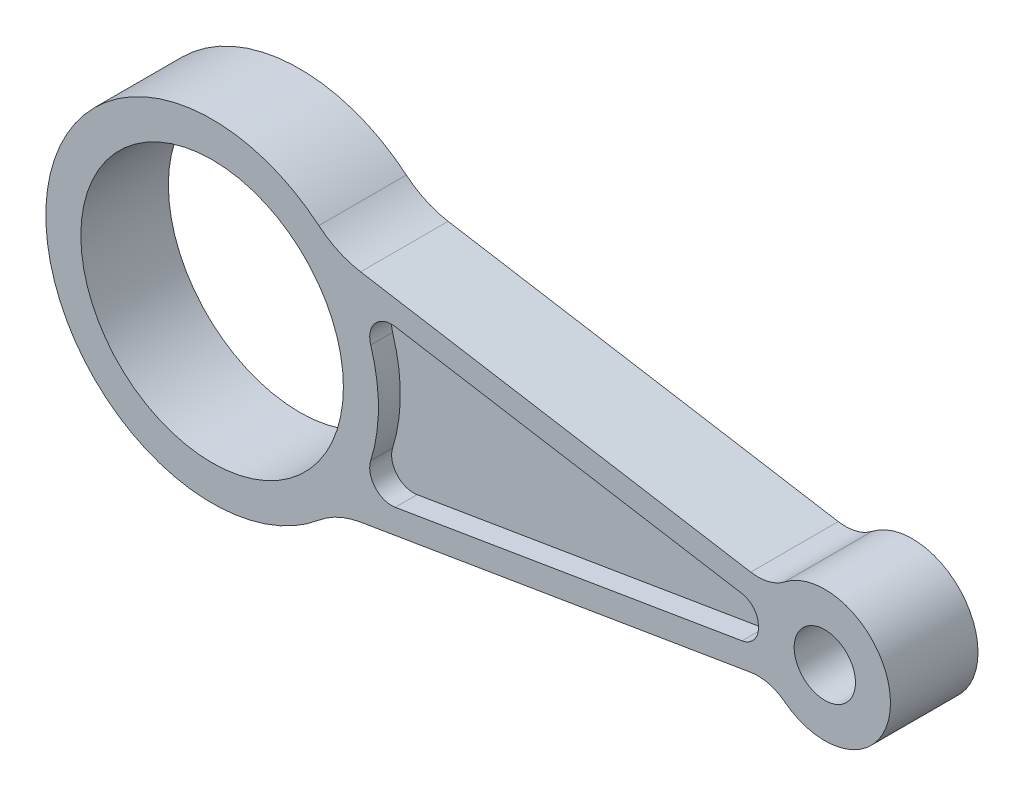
ISO-10303-21;
HEADER;
FILE_DESCRIPTION(('STEP AP214'),'2;1');
FILE_NAME('part.step','',(''),(''),'','','');
FILE_SCHEMA(('AUTOMOTIVE_DESIGN { 1 0 10303 214 1 1 1 1 }'));
ENDSEC;
DATA;
#1=APPLICATION_CONTEXT('core data for automotive mechanical design processes');
#2=APPLICATION_PROTOCOL_DEFINITION('international standard','automotive_design',2000,#1);
#3=PRODUCT_CONTEXT('',#1,'mechanical');
#4=PRODUCT('Part','Part','',(#3));
#5=PRODUCT_RELATED_PRODUCT_CATEGORY('part','',(#4));
#6=PRODUCT_DEFINITION_FORMATION('','',#4);
#7=PRODUCT_DEFINITION_CONTEXT('part definition',#1,'design');
#8=PRODUCT_DEFINITION('design','',#6,#7);
#9=PRODUCT_DEFINITION_SHAPE('','',#8);
#10=(LENGTH_UNIT() NAMED_UNIT(*) SI_UNIT(.MILLI.,.METRE.));
#11=(NAMED_UNIT(*) PLANE_ANGLE_UNIT() SI_UNIT($,.RADIAN.));
#12=(NAMED_UNIT(*) SI_UNIT($,.STERADIAN.) SOLID_ANGLE_UNIT());
#13=UNCERTAINTY_MEASURE_WITH_UNIT(LENGTH_MEASURE(1.E-05),#10,'distance_accuracy_value','');
#14=(GEOMETRIC_REPRESENTATION_CONTEXT(3) GLOBAL_UNCERTAINTY_ASSIGNED_CONTEXT((#13)) GLOBAL_UNIT_ASSIGNED_CONTEXT((#10,
#11,#12)) REPRESENTATION_CONTEXT('',''));
#15=CARTESIAN_POINT('',(0.,0.,0.));
#16=DIRECTION('',(0.,0.,1.));
#17=DIRECTION('',(1.,0.,0.));
#18=AXIS2_PLACEMENT_3D('',#15,#16,#17);
#19=CARTESIAN_POINT('',(0.,0.,-20.));
#20=DIRECTION('',(0.,0.,1.));
#21=DIRECTION('',(1.,0.,0.));
#22=AXIS2_PLACEMENT_3D('',#19,#20,#21);
#23=CYLINDRICAL_SURFACE('',#22,38.);
#24=CARTESIAN_POINT('',(0.,0.,0.));
#25=DIRECTION('',(0.,0.,1.));
#26=DIRECTION('',(1.,0.,0.));
#27=AXIS2_PLACEMENT_3D('',#24,#25,#26);
#28=CIRCLE('',#27,38.);
#29=CARTESIAN_POINT('',(24.3781675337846,29.1496989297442,0.));
#30=VERTEX_POINT('',#29);
#31=CARTESIAN_POINT('',(24.3781675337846,-29.1496989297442,0.));
#32=VERTEX_POINT('',#31);
#33=EDGE_CURVE('E309',#30,#32,#28,.T.);
#34=ORIENTED_EDGE('',*,*,#33,.F.);
#35=DIRECTION('',(0.,0.,1.));
#36=VECTOR('',#35,1.);
#37=CARTESIAN_POINT('',(24.3781675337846,29.1496989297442,-20.));
#38=LINE('',#37,#36);
#39=CARTESIAN_POINT('',(24.3781675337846,29.1496989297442,-20.));
#40=VERTEX_POINT('',#39);
#41=EDGE_CURVE('E358',#30,#40,#38,.F.);
#42=ORIENTED_EDGE('',*,*,#41,.T.);
#43=CARTESIAN_POINT('',(0.,0.,-20.));
#44=DIRECTION('',(0.,0.,1.));
#45=DIRECTION('',(1.,0.,0.));
#46=AXIS2_PLACEMENT_3D('',#43,#44,#45);
#47=CIRCLE('',#46,38.);
#48=CARTESIAN_POINT('',(24.3781675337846,-29.1496989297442,-20.));
#49=VERTEX_POINT('',#48);
#50=EDGE_CURVE('E312',#40,#49,#47,.T.);
#51=ORIENTED_EDGE('',*,*,#50,.T.);
#52=DIRECTION('',(0.,0.,1.));
#53=VECTOR('',#52,1.);
#54=CARTESIAN_POINT('',(24.3781675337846,-29.1496989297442,-20.));
#55=LINE('',#54,#53);
#56=EDGE_CURVE('E355',#49,#32,#55,.T.);
#57=ORIENTED_EDGE('',*,*,#56,.T.);
#58=EDGE_LOOP('',(#34,#42,#51,#57));
#59=FACE_BOUND('',#58,.T.);
#60=ADVANCED_FACE('F35',(#59),#23,.T.);
#61=CARTESIAN_POINT('',(27.9354736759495,25.7606154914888,-20.));
#62=DIRECTION('',(0.164285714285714,0.986412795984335,0.));
#63=DIRECTION('',(-0.986412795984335,0.164285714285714,0.));
#64=AXIS2_PLACEMENT_3D('',#61,#62,#63);
#65=PLANE('',#64);
#66=DIRECTION('',(-0.986412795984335,0.164285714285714,0.));
#67=VECTOR('',#66,1.);
#68=CARTESIAN_POINT('',(27.9354736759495,25.7606154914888,-20.));
#69=LINE('',#68,#67);
#70=CARTESIAN_POINT('',(123.068754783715,9.91629645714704,-20.));
#71=VERTEX_POINT('',#70);
#72=CARTESIAN_POINT('',(33.9230677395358,24.7633898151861,-20.));
#73=VERTEX_POINT('',#72);
#74=EDGE_CURVE('E321',#71,#73,#69,.T.);
#75=ORIENTED_EDGE('',*,*,#74,.T.);
#76=DIRECTION('',(0.,0.,-1.));
#77=VECTOR('',#76,1.);
#78=CARTESIAN_POINT('',(33.9230677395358,24.7633898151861,0.));
#79=LINE('',#78,#77);
#80=CARTESIAN_POINT('',(33.9230677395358,24.7633898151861,0.));
#81=VERTEX_POINT('',#80);
#82=EDGE_CURVE('E352',#73,#81,#79,.F.);
#83=ORIENTED_EDGE('',*,*,#82,.T.);
#84=DIRECTION('',(-0.986412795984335,0.164285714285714,0.));
#85=VECTOR('',#84,1.);
#86=CARTESIAN_POINT('',(27.9354736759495,25.7606154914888,0.));
#87=LINE('',#86,#85);
#88=CARTESIAN_POINT('',(123.068754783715,9.91629645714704,0.));
#89=VERTEX_POINT('',#88);
#90=EDGE_CURVE('E316',#89,#81,#87,.T.);
#91=ORIENTED_EDGE('',*,*,#90,.F.);
#92=DIRECTION('',(0.,0.,-1.));
#93=VECTOR('',#92,1.);
#94=CARTESIAN_POINT('',(123.068754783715,9.91629645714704,-20.));
#95=LINE('',#94,#93);
#96=EDGE_CURVE('E338',#89,#71,#95,.T.);
#97=ORIENTED_EDGE('',*,*,#96,.T.);
#98=EDGE_LOOP('',(#75,#83,#91,#97));
#99=FACE_BOUND('',#98,.T.);
#100=ADVANCED_FACE('F390',(#99),#65,.T.);
#101=CARTESIAN_POINT('',(140.,0.,-20.));
#102=DIRECTION('',(0.,0.,1.));
#103=DIRECTION('',(1.,0.,0.));
#104=AXIS2_PLACEMENT_3D('',#101,#102,#103);
#105=CYLINDRICAL_SURFACE('',#104,15.);
#106=CARTESIAN_POINT('',(140.,0.,-20.));
#107=DIRECTION('',(0.,0.,1.));
#108=DIRECTION('',(1.,0.,0.));
#109=AXIS2_PLACEMENT_3D('',#106,#107,#108);
#110=CIRCLE('',#109,15.);
#111=CARTESIAN_POINT('',(130.826967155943,-11.8682546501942,-20.));
#112=VERTEX_POINT('',#111);
#113=CARTESIAN_POINT('',(130.826967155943,11.8682546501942,-20.));
#114=VERTEX_POINT('',#113);
#115=EDGE_CURVE('E318',#112,#114,#110,.T.);
#116=ORIENTED_EDGE('',*,*,#115,.T.);
#117=DIRECTION('',(0.,0.,1.));
#118=VECTOR('',#117,1.);
#119=CARTESIAN_POINT('',(130.826967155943,11.8682546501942,-20.));
#120=LINE('',#119,#118);
#121=CARTESIAN_POINT('',(130.826967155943,11.8682546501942,0.));
#122=VERTEX_POINT('',#121);
#123=EDGE_CURVE('E335',#114,#122,#120,.T.);
#124=ORIENTED_EDGE('',*,*,#123,.T.);
#125=CARTESIAN_POINT('',(140.,0.,0.));
#126=DIRECTION('',(0.,0.,1.));
#127=DIRECTION('',(1.,0.,0.));
#128=AXIS2_PLACEMENT_3D('',#125,#126,#127);
#129=CIRCLE('',#128,15.);
#130=CARTESIAN_POINT('',(130.826967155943,-11.8682546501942,0.));
#131=VERTEX_POINT('',#130);
#132=EDGE_CURVE('E329',#131,#122,#129,.T.);
#133=ORIENTED_EDGE('',*,*,#132,.F.);
#134=DIRECTION('',(0.,0.,1.));
#135=VECTOR('',#134,1.);
#136=CARTESIAN_POINT('',(130.826967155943,-11.8682546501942,-20.));
#137=LINE('',#136,#135);
#138=EDGE_CURVE('E324',#131,#112,#137,.F.);
#139=ORIENTED_EDGE('',*,*,#138,.T.);
#140=EDGE_LOOP('',(#116,#124,#133,#139));
#141=FACE_BOUND('',#140,.T.);
#142=ADVANCED_FACE('F399',(#141),#105,.T.);
#143=CARTESIAN_POINT('',(27.9354736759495,-25.7606154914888,-20.));
#144=DIRECTION('',(0.164285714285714,-0.986412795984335,0.));
#145=DIRECTION('',(0.986412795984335,0.164285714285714,0.));
#146=AXIS2_PLACEMENT_3D('',#143,#144,#145);
#147=PLANE('',#146);
#148=DIRECTION('',(0.986412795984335,0.164285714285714,0.));
#149=VECTOR('',#148,1.);
#150=CARTESIAN_POINT('',(27.9354736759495,-25.7606154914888,0.));
#151=LINE('',#150,#149);
#152=CARTESIAN_POINT('',(33.9230677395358,-24.7633898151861,0.));
#153=VERTEX_POINT('',#152);
#154=CARTESIAN_POINT('',(123.068754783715,-9.91629645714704,0.));
#155=VERTEX_POINT('',#154);
#156=EDGE_CURVE('E327',#153,#155,#151,.T.);
#157=ORIENTED_EDGE('',*,*,#156,.F.);
#158=DIRECTION('',(0.,0.,-1.));
#159=VECTOR('',#158,1.);
#160=CARTESIAN_POINT('',(33.9230677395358,-24.7633898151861,-20.));
#161=LINE('',#160,#159);
#162=CARTESIAN_POINT('',(33.9230677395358,-24.7633898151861,-20.));
#163=VERTEX_POINT('',#162);
#164=EDGE_CURVE('E360',#153,#163,#161,.T.);
#165=ORIENTED_EDGE('',*,*,#164,.T.);
#166=DIRECTION('',(0.986412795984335,0.164285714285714,0.));
#167=VECTOR('',#166,1.);
#168=CARTESIAN_POINT('',(27.9354736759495,-25.7606154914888,-20.));
#169=LINE('',#168,#167);
#170=CARTESIAN_POINT('',(123.068754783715,-9.91629645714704,-20.));
#171=VERTEX_POINT('',#170);
#172=EDGE_CURVE('E315',#163,#171,#169,.T.);
#173=ORIENTED_EDGE('',*,*,#172,.T.);
#174=DIRECTION('',(0.,0.,-1.));
#175=VECTOR('',#174,1.);
#176=CARTESIAN_POINT('',(123.068754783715,-9.91629645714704,0.));
#177=LINE('',#176,#175);
#178=EDGE_CURVE('E340',#171,#155,#177,.F.);
#179=ORIENTED_EDGE('',*,*,#178,.T.);
#180=EDGE_LOOP('',(#157,#165,#173,#179));
#181=FACE_BOUND('',#180,.T.);
#182=ADVANCED_FACE('F374',(#181),#147,.T.);
#183=CARTESIAN_POINT('',(0.,0.,-20.));
#184=DIRECTION('',(0.,0.,1.));
#185=DIRECTION('',(1.,0.,0.));
#186=AXIS2_PLACEMENT_3D('',#183,#184,#185);
#187=PLANE('',#186);
#188=DIRECTION('',(0.986412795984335,-0.164285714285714,0.));
#189=VECTOR('',#188,1.);
#190=CARTESIAN_POINT('',(121.445609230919,4.61087017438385,-20.));
#191=LINE('',#190,#189);
#192=CARTESIAN_POINT('',(41.8285545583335,17.8709827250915,-20.));
#193=VERTEX_POINT('',#192);
#194=CARTESIAN_POINT('',(121.445609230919,4.61087017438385,-20.));
#195=VERTEX_POINT('',#194);
#196=EDGE_CURVE('E221',#193,#195,#191,.T.);
#197=ORIENTED_EDGE('',*,*,#196,.F.);
#198=CARTESIAN_POINT('',(41.0071259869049,12.9389187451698,-20.));
#199=DIRECTION('',(0.,0.,-1.));
#200=DIRECTION('',(1.,0.,0.));
#201=AXIS2_PLACEMENT_3D('',#198,#199,#200);
#202=CIRCLE('',#201,5.);
#203=CARTESIAN_POINT('',(36.2388555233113,11.4343933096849,-20.));
#204=VERTEX_POINT('',#203);
#205=EDGE_CURVE('E50',#204,#193,#202,.T.);
#206=ORIENTED_EDGE('',*,*,#205,.F.);
#207=CARTESIAN_POINT('',(0.,0.,-20.));
#208=DIRECTION('',(0.,0.,1.));
#209=DIRECTION('',(-1.,0.,0.));
#210=AXIS2_PLACEMENT_3D('',#207,#208,#209);
#211=CIRCLE('',#210,38.);
#212=CARTESIAN_POINT('',(36.2388555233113,-11.4343933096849,-20.));
#213=VERTEX_POINT('',#212);
#214=EDGE_CURVE('E204',#213,#204,#211,.T.);
#215=ORIENTED_EDGE('',*,*,#214,.F.);
#216=CARTESIAN_POINT('',(41.0071259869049,-12.9389187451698,-20.));
#217=DIRECTION('',(0.,0.,-1.));
#218=DIRECTION('',(-1.,0.,0.));
#219=AXIS2_PLACEMENT_3D('',#216,#217,#218);
#220=CIRCLE('',#219,5.);
#221=CARTESIAN_POINT('',(41.8285545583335,-17.8709827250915,-20.));
#222=VERTEX_POINT('',#221);
#223=EDGE_CURVE('E207',#222,#213,#220,.T.);
#224=ORIENTED_EDGE('',*,*,#223,.F.);
#225=DIRECTION('',(-0.986412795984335,-0.164285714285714,0.));
#226=VECTOR('',#225,1.);
#227=CARTESIAN_POINT('',(121.433526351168,-4.61288256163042,-20.));
#228=LINE('',#227,#226);
#229=CARTESIAN_POINT('',(121.433526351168,-4.61288256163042,-20.));
#230=VERTEX_POINT('',#229);
#231=EDGE_CURVE('E229',#230,#222,#228,.T.);
#232=ORIENTED_EDGE('',*,*,#231,.F.);
#233=CARTESIAN_POINT('',(120.694240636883,-0.174024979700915,-20.));
#234=DIRECTION('',(0.,0.,-1.));
#235=DIRECTION('',(-1.,0.,0.));
#236=AXIS2_PLACEMENT_3D('',#233,#234,#235);
#237=CIRCLE('',#236,4.5);
#238=CARTESIAN_POINT('',(125.194211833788,-0.157924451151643,-20.));
#239=VERTEX_POINT('',#238);
#240=EDGE_CURVE('E226',#239,#230,#237,.T.);
#241=ORIENTED_EDGE('',*,*,#240,.F.);
#242=CARTESIAN_POINT('',(120.706323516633,0.172012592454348,-20.));
#243=DIRECTION('',(0.,0.,-1.));
#244=DIRECTION('',(1.,0.,0.));
#245=AXIS2_PLACEMENT_3D('',#242,#243,#244);
#246=CIRCLE('',#245,4.5);
#247=EDGE_CURVE('E223',#195,#239,#246,.T.);
#248=ORIENTED_EDGE('',*,*,#247,.F.);
#249=EDGE_LOOP('',(#197,#206,#215,#224,#232,#241,#248));
#250=FACE_BOUND('',#249,.T.);
#251=CARTESIAN_POINT('',(140.,0.,-20.));
#252=DIRECTION('',(0.,0.,1.));
#253=DIRECTION('',(1.,0.,0.));
#254=AXIS2_PLACEMENT_3D('',#251,#252,#253);
#255=CIRCLE('',#254,7.00000000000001);
#256=CARTESIAN_POINT('',(147.,0.,-20.));
#257=VERTEX_POINT('',#256);
#258=EDGE_CURVE('E300',#257,#257,#255,.T.);
#259=ORIENTED_EDGE('',*,*,#258,.T.);
#260=EDGE_LOOP('',(#259));
#261=FACE_BOUND('',#260,.T.);
#262=CARTESIAN_POINT('',(0.,0.,-20.));
#263=DIRECTION('',(0.,0.,1.));
#264=DIRECTION('',(1.,0.,0.));
#265=AXIS2_PLACEMENT_3D('',#262,#263,#264);
#266=CIRCLE('',#265,30.);
#267=CARTESIAN_POINT('',(30.,0.,-20.));
#268=VERTEX_POINT('',#267);
#269=EDGE_CURVE('E306',#268,#268,#266,.T.);
#270=ORIENTED_EDGE('',*,*,#269,.T.);
#271=EDGE_LOOP('',(#270));
#272=FACE_BOUND('',#271,.T.);
#273=ORIENTED_EDGE('',*,*,#50,.F.);
#274=CARTESIAN_POINT('',(37.2087820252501,44.4916457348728,-20.));
#275=DIRECTION('',(0.,0.,1.));
#276=DIRECTION('',(1.,0.,0.));
#277=AXIS2_PLACEMENT_3D('',#274,#275,#276);
#278=CIRCLE('',#277,20.);
#279=EDGE_CURVE('E364',#40,#73,#278,.T.);
#280=ORIENTED_EDGE('',*,*,#279,.T.);
#281=ORIENTED_EDGE('',*,*,#74,.F.);
#282=CARTESIAN_POINT('',(124.711611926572,19.7804244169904,-20.));
#283=DIRECTION('',(0.,0.,1.));
#284=DIRECTION('',(1.,0.,0.));
#285=AXIS2_PLACEMENT_3D('',#282,#283,#284);
#286=CIRCLE('',#285,10.);
#287=EDGE_CURVE('E345',#71,#114,#286,.T.);
#288=ORIENTED_EDGE('',*,*,#287,.T.);
#289=ORIENTED_EDGE('',*,*,#115,.F.);
#290=CARTESIAN_POINT('',(124.711611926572,-19.7804244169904,-20.));
#291=DIRECTION('',(0.,0.,1.));
#292=DIRECTION('',(1.,0.,0.));
#293=AXIS2_PLACEMENT_3D('',#290,#291,#292);
#294=CIRCLE('',#293,10.);
#295=EDGE_CURVE('E349',#112,#171,#294,.T.);
#296=ORIENTED_EDGE('',*,*,#295,.T.);
#297=ORIENTED_EDGE('',*,*,#172,.F.);
#298=CARTESIAN_POINT('',(37.2087820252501,-44.4916457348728,-20.));
#299=DIRECTION('',(0.,0.,1.));
#300=DIRECTION('',(1.,0.,0.));
#301=AXIS2_PLACEMENT_3D('',#298,#299,#300);
#302=CIRCLE('',#301,20.);
#303=EDGE_CURVE('E11',#163,#49,#302,.T.);
#304=ORIENTED_EDGE('',*,*,#303,.T.);
#305=EDGE_LOOP('',(#273,#280,#281,#288,#289,#296,#297,#304));
#306=FACE_BOUND('',#305,.T.);
#307=ADVANCED_FACE('F380',(#250,#261,#272,#306),#187,.F.);
#308=CARTESIAN_POINT('',(0.,0.,0.));
#309=DIRECTION('',(0.,0.,1.));
#310=DIRECTION('',(1.,0.,0.));
#311=AXIS2_PLACEMENT_3D('',#308,#309,#310);
#312=PLANE('',#311);
#313=CARTESIAN_POINT('',(41.0071259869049,12.9389187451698,0.));
#314=DIRECTION('',(0.,0.,1.));
#315=DIRECTION('',(-1.,0.,0.));
#316=AXIS2_PLACEMENT_3D('',#313,#314,#315);
#317=CIRCLE('',#316,5.);
#318=CARTESIAN_POINT('',(41.8285545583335,17.8709827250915,0.));
#319=VERTEX_POINT('',#318);
#320=CARTESIAN_POINT('',(36.2388555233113,11.4343933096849,0.));
#321=VERTEX_POINT('',#320);
#322=EDGE_CURVE('E58',#319,#321,#317,.T.);
#323=ORIENTED_EDGE('',*,*,#322,.F.);
#324=DIRECTION('',(-0.986412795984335,0.164285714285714,0.));
#325=VECTOR('',#324,1.);
#326=CARTESIAN_POINT('',(41.8285545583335,17.8709827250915,0.));
#327=LINE('',#326,#325);
#328=CARTESIAN_POINT('',(121.046940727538,4.67726787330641,0.));
#329=VERTEX_POINT('',#328);
#330=EDGE_CURVE('E249',#329,#319,#327,.T.);
#331=ORIENTED_EDGE('',*,*,#330,.F.);
#332=CARTESIAN_POINT('',(120.307655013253,0.238410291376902,0.));
#333=DIRECTION('',(0.,0.,1.));
#334=DIRECTION('',(1.,0.,0.));
#335=AXIS2_PLACEMENT_3D('',#332,#333,#334);
#336=CIRCLE('',#335,4.5);
#337=CARTESIAN_POINT('',(124.807655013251,0.238406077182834,0.));
#338=VERTEX_POINT('',#337);
#339=EDGE_CURVE('E281',#338,#329,#336,.T.);
#340=ORIENTED_EDGE('',*,*,#339,.F.);
#341=CARTESIAN_POINT('',(120.332548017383,-0.234264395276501,0.));
#342=DIRECTION('',(0.,0.,1.));
#343=DIRECTION('',(-1.,0.,0.));
#344=AXIS2_PLACEMENT_3D('',#341,#342,#343);
#345=CIRCLE('',#344,4.5);
#346=CARTESIAN_POINT('',(121.071833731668,-4.67312197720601,0.));
#347=VERTEX_POINT('',#346);
#348=EDGE_CURVE('E278',#347,#338,#345,.T.);
#349=ORIENTED_EDGE('',*,*,#348,.F.);
#350=DIRECTION('',(0.986412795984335,0.164285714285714,0.));
#351=VECTOR('',#350,1.);
#352=CARTESIAN_POINT('',(41.8285545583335,-17.8709827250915,0.));
#353=LINE('',#352,#351);
#354=CARTESIAN_POINT('',(41.8285545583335,-17.8709827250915,0.));
#355=VERTEX_POINT('',#354);
#356=EDGE_CURVE('E275',#355,#347,#353,.T.);
#357=ORIENTED_EDGE('',*,*,#356,.F.);
#358=CARTESIAN_POINT('',(41.0071259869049,-12.9389187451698,0.));
#359=DIRECTION('',(0.,0.,1.));
#360=DIRECTION('',(-1.,0.,0.));
#361=AXIS2_PLACEMENT_3D('',#358,#359,#360);
#362=CIRCLE('',#361,5.);
#363=CARTESIAN_POINT('',(36.2388555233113,-11.4343933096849,0.));
#364=VERTEX_POINT('',#363);
#365=EDGE_CURVE('E272',#364,#355,#362,.T.);
#366=ORIENTED_EDGE('',*,*,#365,.F.);
#367=CARTESIAN_POINT('',(0.,0.,0.));
#368=DIRECTION('',(0.,0.,-1.));
#369=DIRECTION('',(1.,0.,0.));
#370=AXIS2_PLACEMENT_3D('',#367,#368,#369);
#371=CIRCLE('',#370,38.);
#372=EDGE_CURVE('E269',#321,#364,#371,.T.);
#373=ORIENTED_EDGE('',*,*,#372,.F.);
#374=EDGE_LOOP('',(#323,#331,#340,#349,#357,#366,#373));
#375=FACE_BOUND('',#374,.T.);
#376=CARTESIAN_POINT('',(140.,0.,0.));
#377=DIRECTION('',(0.,0.,1.));
#378=DIRECTION('',(1.,0.,0.));
#379=AXIS2_PLACEMENT_3D('',#376,#377,#378);
#380=CIRCLE('',#379,7.00000000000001);
#381=CARTESIAN_POINT('',(147.,0.,0.));
#382=VERTEX_POINT('',#381);
#383=EDGE_CURVE('E288',#382,#382,#380,.T.);
#384=ORIENTED_EDGE('',*,*,#383,.F.);
#385=EDGE_LOOP('',(#384));
#386=FACE_BOUND('',#385,.T.);
#387=CARTESIAN_POINT('',(0.,0.,0.));
#388=DIRECTION('',(0.,0.,1.));
#389=DIRECTION('',(1.,0.,0.));
#390=AXIS2_PLACEMENT_3D('',#387,#388,#389);
#391=CIRCLE('',#390,30.);
#392=CARTESIAN_POINT('',(30.,0.,0.));
#393=VERTEX_POINT('',#392);
#394=EDGE_CURVE('E303',#393,#393,#391,.T.);
#395=ORIENTED_EDGE('',*,*,#394,.F.);
#396=EDGE_LOOP('',(#395));
#397=FACE_BOUND('',#396,.T.);
#398=ORIENTED_EDGE('',*,*,#90,.T.);
#399=CARTESIAN_POINT('',(37.2087820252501,44.4916457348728,0.));
#400=DIRECTION('',(0.,0.,1.));
#401=DIRECTION('',(1.,0.,0.));
#402=AXIS2_PLACEMENT_3D('',#399,#400,#401);
#403=CIRCLE('',#402,20.);
#404=EDGE_CURVE('E362',#81,#30,#403,.F.);
#405=ORIENTED_EDGE('',*,*,#404,.T.);
#406=ORIENTED_EDGE('',*,*,#33,.T.);
#407=CARTESIAN_POINT('',(37.2087820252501,-44.4916457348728,0.));
#408=DIRECTION('',(0.,0.,1.));
#409=DIRECTION('',(1.,0.,0.));
#410=AXIS2_PLACEMENT_3D('',#407,#408,#409);
#411=CIRCLE('',#410,20.);
#412=EDGE_CURVE('E43',#32,#153,#411,.F.);
#413=ORIENTED_EDGE('',*,*,#412,.T.);
#414=ORIENTED_EDGE('',*,*,#156,.T.);
#415=CARTESIAN_POINT('',(124.711611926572,-19.7804244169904,0.));
#416=DIRECTION('',(0.,0.,1.));
#417=DIRECTION('',(1.,0.,0.));
#418=AXIS2_PLACEMENT_3D('',#415,#416,#417);
#419=CIRCLE('',#418,10.);
#420=EDGE_CURVE('E347',#155,#131,#419,.F.);
#421=ORIENTED_EDGE('',*,*,#420,.T.);
#422=ORIENTED_EDGE('',*,*,#132,.T.);
#423=CARTESIAN_POINT('',(124.711611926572,19.7804244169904,0.));
#424=DIRECTION('',(0.,0.,1.));
#425=DIRECTION('',(1.,0.,0.));
#426=AXIS2_PLACEMENT_3D('',#423,#424,#425);
#427=CIRCLE('',#426,10.);
#428=EDGE_CURVE('E343',#122,#89,#427,.F.);
#429=ORIENTED_EDGE('',*,*,#428,.T.);
#430=EDGE_LOOP('',(#398,#405,#406,#413,#414,#421,#422,#429));
#431=FACE_BOUND('',#430,.T.);
#432=ADVANCED_FACE('F367',(#375,#386,#397,#431),#312,.T.);
#433=CARTESIAN_POINT('',(0.,0.,-20.));
#434=DIRECTION('',(0.,0.,1.));
#435=DIRECTION('',(1.,0.,0.));
#436=AXIS2_PLACEMENT_3D('',#433,#434,#435);
#437=CYLINDRICAL_SURFACE('',#436,30.);
#438=ORIENTED_EDGE('',*,*,#269,.F.);
#439=EDGE_LOOP('',(#438));
#440=FACE_BOUND('',#439,.T.);
#441=ORIENTED_EDGE('',*,*,#394,.T.);
#442=EDGE_LOOP('',(#441));
#443=FACE_BOUND('',#442,.T.);
#444=ADVANCED_FACE('F425',(#440,#443),#437,.F.);
#445=CARTESIAN_POINT('',(140.,0.,-20.));
#446=DIRECTION('',(0.,0.,1.));
#447=DIRECTION('',(1.,0.,0.));
#448=AXIS2_PLACEMENT_3D('',#445,#446,#447);
#449=CYLINDRICAL_SURFACE('',#448,7.00000000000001);
#450=ORIENTED_EDGE('',*,*,#258,.F.);
#451=EDGE_LOOP('',(#450));
#452=FACE_BOUND('',#451,.T.);
#453=ORIENTED_EDGE('',*,*,#383,.T.);
#454=EDGE_LOOP('',(#453));
#455=FACE_BOUND('',#454,.T.);
#456=ADVANCED_FACE('F410',(#452,#455),#449,.F.);
#457=CARTESIAN_POINT('',(124.711611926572,19.7804244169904,-20.));
#458=DIRECTION('',(0.,0.,1.));
#459=DIRECTION('',(1.,0.,0.));
#460=AXIS2_PLACEMENT_3D('',#457,#458,#459);
#461=CYLINDRICAL_SURFACE('',#460,10.);
#462=ORIENTED_EDGE('',*,*,#287,.F.);
#463=ORIENTED_EDGE('',*,*,#96,.F.);
#464=ORIENTED_EDGE('',*,*,#428,.F.);
#465=ORIENTED_EDGE('',*,*,#123,.F.);
#466=EDGE_LOOP('',(#462,#463,#464,#465));
#467=FACE_BOUND('',#466,.T.);
#468=ADVANCED_FACE('F394',(#467),#461,.F.);
#469=CARTESIAN_POINT('',(124.711611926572,-19.7804244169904,-20.));
#470=DIRECTION('',(0.,0.,1.));
#471=DIRECTION('',(1.,0.,0.));
#472=AXIS2_PLACEMENT_3D('',#469,#470,#471);
#473=CYLINDRICAL_SURFACE('',#472,10.);
#474=ORIENTED_EDGE('',*,*,#295,.F.);
#475=ORIENTED_EDGE('',*,*,#138,.F.);
#476=ORIENTED_EDGE('',*,*,#420,.F.);
#477=ORIENTED_EDGE('',*,*,#178,.F.);
#478=EDGE_LOOP('',(#474,#475,#476,#477));
#479=FACE_BOUND('',#478,.T.);
#480=ADVANCED_FACE('F403',(#479),#473,.F.);
#481=CARTESIAN_POINT('',(37.2087820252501,44.4916457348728,-20.));
#482=DIRECTION('',(0.,0.,1.));
#483=DIRECTION('',(1.,0.,0.));
#484=AXIS2_PLACEMENT_3D('',#481,#482,#483);
#485=CYLINDRICAL_SURFACE('',#484,20.);
#486=ORIENTED_EDGE('',*,*,#279,.F.);
#487=ORIENTED_EDGE('',*,*,#41,.F.);
#488=ORIENTED_EDGE('',*,*,#404,.F.);
#489=ORIENTED_EDGE('',*,*,#82,.F.);
#490=EDGE_LOOP('',(#486,#487,#488,#489));
#491=FACE_BOUND('',#490,.T.);
#492=ADVANCED_FACE('F385',(#491),#485,.F.);
#493=CARTESIAN_POINT('',(37.2087820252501,-44.4916457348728,-20.));
#494=DIRECTION('',(0.,0.,1.));
#495=DIRECTION('',(1.,0.,0.));
#496=AXIS2_PLACEMENT_3D('',#493,#494,#495);
#497=CYLINDRICAL_SURFACE('',#496,20.);
#498=ORIENTED_EDGE('',*,*,#303,.F.);
#499=ORIENTED_EDGE('',*,*,#164,.F.);
#500=ORIENTED_EDGE('',*,*,#412,.F.);
#501=ORIENTED_EDGE('',*,*,#56,.F.);
#502=EDGE_LOOP('',(#498,#499,#500,#501));
#503=FACE_BOUND('',#502,.T.);
#504=ADVANCED_FACE('F37',(#503),#497,.F.);
#505=CARTESIAN_POINT('',(41.0071259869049,12.9389187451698,-5.));
#506=DIRECTION('',(0.,0.,1.));
#507=DIRECTION('',(1.,0.,0.));
#508=AXIS2_PLACEMENT_3D('',#505,#506,#507);
#509=CYLINDRICAL_SURFACE('',#508,5.);
#510=ORIENTED_EDGE('',*,*,#322,.T.);
#511=DIRECTION('',(0.,0.,1.));
#512=VECTOR('',#511,1.);
#513=CARTESIAN_POINT('',(36.2388555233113,11.4343933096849,-5.));
#514=LINE('',#513,#512);
#515=CARTESIAN_POINT('',(36.2388555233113,11.4343933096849,-5.));
#516=VERTEX_POINT('',#515);
#517=EDGE_CURVE('E267',#516,#321,#514,.T.);
#518=ORIENTED_EDGE('',*,*,#517,.F.);
#519=CARTESIAN_POINT('',(41.0071259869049,12.9389187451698,-5.));
#520=DIRECTION('',(0.,0.,1.));
#521=DIRECTION('',(-1.,0.,0.));
#522=AXIS2_PLACEMENT_3D('',#519,#520,#521);
#523=CIRCLE('',#522,5.);
#524=CARTESIAN_POINT('',(41.8285545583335,17.8709827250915,-5.));
#525=VERTEX_POINT('',#524);
#526=EDGE_CURVE('E245',#525,#516,#523,.T.);
#527=ORIENTED_EDGE('',*,*,#526,.F.);
#528=DIRECTION('',(0.,0.,1.));
#529=VECTOR('',#528,1.);
#530=CARTESIAN_POINT('',(41.8285545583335,17.8709827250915,-5.));
#531=LINE('',#530,#529);
#532=EDGE_CURVE('E286',#525,#319,#531,.T.);
#533=ORIENTED_EDGE('',*,*,#532,.T.);
#534=EDGE_LOOP('',(#510,#518,#527,#533));
#535=FACE_BOUND('',#534,.T.);
#536=ADVANCED_FACE('F436',(#535),#509,.F.);
#537=CARTESIAN_POINT('',(41.8285545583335,17.8709827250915,-5.));
#538=DIRECTION('',(0.164285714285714,0.986412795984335,0.));
#539=DIRECTION('',(-0.986412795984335,0.164285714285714,0.));
#540=AXIS2_PLACEMENT_3D('',#537,#538,#539);
#541=PLANE('',#540);
#542=ORIENTED_EDGE('',*,*,#330,.T.);
#543=ORIENTED_EDGE('',*,*,#532,.F.);
#544=DIRECTION('',(-0.986412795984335,0.164285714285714,0.));
#545=VECTOR('',#544,1.);
#546=CARTESIAN_POINT('',(41.8285545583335,17.8709827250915,-5.));
#547=LINE('',#546,#545);
#548=CARTESIAN_POINT('',(121.046940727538,4.67726787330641,-5.));
#549=VERTEX_POINT('',#548);
#550=EDGE_CURVE('E264',#549,#525,#547,.T.);
#551=ORIENTED_EDGE('',*,*,#550,.F.);
#552=DIRECTION('',(0.,0.,1.));
#553=VECTOR('',#552,1.);
#554=CARTESIAN_POINT('',(121.046940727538,4.67726787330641,-5.));
#555=LINE('',#554,#553);
#556=EDGE_CURVE('E289',#549,#329,#555,.T.);
#557=ORIENTED_EDGE('',*,*,#556,.T.);
#558=EDGE_LOOP('',(#542,#543,#551,#557));
#559=FACE_BOUND('',#558,.T.);
#560=ADVANCED_FACE('F439',(#559),#541,.F.);
#561=CARTESIAN_POINT('',(120.307655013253,0.238410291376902,-5.));
#562=DIRECTION('',(0.,0.,1.));
#563=DIRECTION('',(1.,0.,0.));
#564=AXIS2_PLACEMENT_3D('',#561,#562,#563);
#565=CYLINDRICAL_SURFACE('',#564,4.5);
#566=ORIENTED_EDGE('',*,*,#339,.T.);
#567=ORIENTED_EDGE('',*,*,#556,.F.);
#568=CARTESIAN_POINT('',(120.307655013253,0.238410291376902,-5.));
#569=DIRECTION('',(0.,0.,1.));
#570=DIRECTION('',(1.,0.,0.));
#571=AXIS2_PLACEMENT_3D('',#568,#569,#570);
#572=CIRCLE('',#571,4.5);
#573=CARTESIAN_POINT('',(124.807655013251,0.238406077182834,-5.));
#574=VERTEX_POINT('',#573);
#575=EDGE_CURVE('E261',#574,#549,#572,.T.);
#576=ORIENTED_EDGE('',*,*,#575,.F.);
#577=DIRECTION('',(0.,0.,1.));
#578=VECTOR('',#577,1.);
#579=CARTESIAN_POINT('',(124.807655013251,0.238406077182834,-5.));
#580=LINE('',#579,#578);
#581=EDGE_CURVE('E291',#574,#338,#580,.T.);
#582=ORIENTED_EDGE('',*,*,#581,.T.);
#583=EDGE_LOOP('',(#566,#567,#576,#582));
#584=FACE_BOUND('',#583,.T.);
#585=ADVANCED_FACE('F456',(#584),#565,.F.);
#586=CARTESIAN_POINT('',(120.332548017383,-0.234264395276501,-5.));
#587=DIRECTION('',(0.,0.,1.));
#588=DIRECTION('',(1.,0.,0.));
#589=AXIS2_PLACEMENT_3D('',#586,#587,#588);
#590=CYLINDRICAL_SURFACE('',#589,4.5);
#591=ORIENTED_EDGE('',*,*,#348,.T.);
#592=ORIENTED_EDGE('',*,*,#581,.F.);
#593=CARTESIAN_POINT('',(120.332548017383,-0.234264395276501,-5.));
#594=DIRECTION('',(0.,0.,1.));
#595=DIRECTION('',(-1.,0.,0.));
#596=AXIS2_PLACEMENT_3D('',#593,#594,#595);
#597=CIRCLE('',#596,4.5);
#598=CARTESIAN_POINT('',(121.071833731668,-4.67312197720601,-5.));
#599=VERTEX_POINT('',#598);
#600=EDGE_CURVE('E258',#599,#574,#597,.T.);
#601=ORIENTED_EDGE('',*,*,#600,.F.);
#602=DIRECTION('',(0.,0.,1.));
#603=VECTOR('',#602,1.);
#604=CARTESIAN_POINT('',(121.071833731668,-4.67312197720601,-5.));
#605=LINE('',#604,#603);
#606=EDGE_CURVE('E293',#599,#347,#605,.T.);
#607=ORIENTED_EDGE('',*,*,#606,.T.);
#608=EDGE_LOOP('',(#591,#592,#601,#607));
#609=FACE_BOUND('',#608,.T.);
#610=ADVANCED_FACE('F452',(#609),#590,.F.);
#611=CARTESIAN_POINT('',(41.8285545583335,-17.8709827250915,-5.));
#612=DIRECTION('',(0.164285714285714,-0.986412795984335,0.));
#613=DIRECTION('',(0.986412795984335,0.164285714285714,0.));
#614=AXIS2_PLACEMENT_3D('',#611,#612,#613);
#615=PLANE('',#614);
#616=ORIENTED_EDGE('',*,*,#356,.T.);
#617=ORIENTED_EDGE('',*,*,#606,.F.);
#618=DIRECTION('',(0.986412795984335,0.164285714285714,0.));
#619=VECTOR('',#618,1.);
#620=CARTESIAN_POINT('',(41.8285545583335,-17.8709827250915,-5.));
#621=LINE('',#620,#619);
#622=CARTESIAN_POINT('',(41.8285545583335,-17.8709827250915,-5.));
#623=VERTEX_POINT('',#622);
#624=EDGE_CURVE('E255',#623,#599,#621,.T.);
#625=ORIENTED_EDGE('',*,*,#624,.F.);
#626=DIRECTION('',(0.,0.,1.));
#627=VECTOR('',#626,1.);
#628=CARTESIAN_POINT('',(41.8285545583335,-17.8709827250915,-5.));
#629=LINE('',#628,#627);
#630=EDGE_CURVE('E295',#623,#355,#629,.T.);
#631=ORIENTED_EDGE('',*,*,#630,.T.);
#632=EDGE_LOOP('',(#616,#617,#625,#631));
#633=FACE_BOUND('',#632,.T.);
#634=ADVANCED_FACE('F448',(#633),#615,.F.);
#635=CARTESIAN_POINT('',(41.0071259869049,-12.9389187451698,-5.));
#636=DIRECTION('',(0.,0.,1.));
#637=DIRECTION('',(1.,0.,0.));
#638=AXIS2_PLACEMENT_3D('',#635,#636,#637);
#639=CYLINDRICAL_SURFACE('',#638,5.);
#640=ORIENTED_EDGE('',*,*,#365,.T.);
#641=ORIENTED_EDGE('',*,*,#630,.F.);
#642=CARTESIAN_POINT('',(41.0071259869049,-12.9389187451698,-5.));
#643=DIRECTION('',(0.,0.,1.));
#644=DIRECTION('',(-1.,0.,0.));
#645=AXIS2_PLACEMENT_3D('',#642,#643,#644);
#646=CIRCLE('',#645,5.);
#647=CARTESIAN_POINT('',(36.2388555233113,-11.4343933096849,-5.));
#648=VERTEX_POINT('',#647);
#649=EDGE_CURVE('E252',#648,#623,#646,.T.);
#650=ORIENTED_EDGE('',*,*,#649,.F.);
#651=DIRECTION('',(0.,0.,1.));
#652=VECTOR('',#651,1.);
#653=CARTESIAN_POINT('',(36.2388555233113,-11.4343933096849,-5.));
#654=LINE('',#653,#652);
#655=EDGE_CURVE('E297',#648,#364,#654,.T.);
#656=ORIENTED_EDGE('',*,*,#655,.T.);
#657=EDGE_LOOP('',(#640,#641,#650,#656));
#658=FACE_BOUND('',#657,.T.);
#659=ADVANCED_FACE('F444',(#658),#639,.F.);
#660=CARTESIAN_POINT('',(0.,0.,-5.));
#661=DIRECTION('',(0.,0.,1.));
#662=DIRECTION('',(1.,0.,0.));
#663=AXIS2_PLACEMENT_3D('',#660,#661,#662);
#664=CYLINDRICAL_SURFACE('',#663,38.);
#665=ORIENTED_EDGE('',*,*,#372,.T.);
#666=ORIENTED_EDGE('',*,*,#655,.F.);
#667=CARTESIAN_POINT('',(0.,0.,-5.));
#668=DIRECTION('',(0.,0.,-1.));
#669=DIRECTION('',(1.,0.,0.));
#670=AXIS2_PLACEMENT_3D('',#667,#668,#669);
#671=CIRCLE('',#670,38.);
#672=EDGE_CURVE('E248',#516,#648,#671,.T.);
#673=ORIENTED_EDGE('',*,*,#672,.F.);
#674=ORIENTED_EDGE('',*,*,#517,.T.);
#675=EDGE_LOOP('',(#665,#666,#673,#674));
#676=FACE_BOUND('',#675,.T.);
#677=ADVANCED_FACE('F440',(#676),#664,.T.);
#678=CARTESIAN_POINT('',(41.0071259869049,12.9389187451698,-5.));
#679=DIRECTION('',(0.,0.,-1.));
#680=DIRECTION('',(-1.,0.,0.));
#681=AXIS2_PLACEMENT_3D('',#678,#679,#680);
#682=PLANE('',#681);
#683=ORIENTED_EDGE('',*,*,#526,.T.);
#684=ORIENTED_EDGE('',*,*,#672,.T.);
#685=ORIENTED_EDGE('',*,*,#649,.T.);
#686=ORIENTED_EDGE('',*,*,#624,.T.);
#687=ORIENTED_EDGE('',*,*,#600,.T.);
#688=ORIENTED_EDGE('',*,*,#575,.T.);
#689=ORIENTED_EDGE('',*,*,#550,.T.);
#690=EDGE_LOOP('',(#683,#684,#685,#686,#687,#688,#689));
#691=FACE_BOUND('',#690,.T.);
#692=ADVANCED_FACE('F443',(#691),#682,.F.);
#693=CARTESIAN_POINT('',(41.0071259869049,12.9389187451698,-15.));
#694=DIRECTION('',(0.,0.,-1.));
#695=DIRECTION('',(-1.,0.,0.));
#696=AXIS2_PLACEMENT_3D('',#693,#694,#695);
#697=CYLINDRICAL_SURFACE('',#696,5.);
#698=ORIENTED_EDGE('',*,*,#205,.T.);
#699=DIRECTION('',(0.,0.,-1.));
#700=VECTOR('',#699,1.);
#701=CARTESIAN_POINT('',(41.8285545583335,17.8709827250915,-15.));
#702=LINE('',#701,#700);
#703=CARTESIAN_POINT('',(41.8285545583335,17.8709827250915,-15.));
#704=VERTEX_POINT('',#703);
#705=EDGE_CURVE('E181',#704,#193,#702,.T.);
#706=ORIENTED_EDGE('',*,*,#705,.F.);
#707=CARTESIAN_POINT('',(41.0071259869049,12.9389187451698,-15.));
#708=DIRECTION('',(0.,0.,-1.));
#709=DIRECTION('',(1.,0.,0.));
#710=AXIS2_PLACEMENT_3D('',#707,#708,#709);
#711=CIRCLE('',#710,5.);
#712=CARTESIAN_POINT('',(36.2388555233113,11.4343933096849,-15.));
#713=VERTEX_POINT('',#712);
#714=EDGE_CURVE('E185',#713,#704,#711,.T.);
#715=ORIENTED_EDGE('',*,*,#714,.F.);
#716=DIRECTION('',(0.,0.,-1.));
#717=VECTOR('',#716,1.);
#718=CARTESIAN_POINT('',(36.2388555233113,11.4343933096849,-15.));
#719=LINE('',#718,#717);
#720=EDGE_CURVE('E234',#713,#204,#719,.T.);
#721=ORIENTED_EDGE('',*,*,#720,.T.);
#722=EDGE_LOOP('',(#698,#706,#715,#721));
#723=FACE_BOUND('',#722,.T.);
#724=ADVANCED_FACE('F183',(#723),#697,.F.);
#725=CARTESIAN_POINT('',(0.,0.,-15.));
#726=DIRECTION('',(0.,0.,-1.));
#727=DIRECTION('',(-1.,0.,0.));
#728=AXIS2_PLACEMENT_3D('',#725,#726,#727);
#729=CYLINDRICAL_SURFACE('',#728,38.);
#730=ORIENTED_EDGE('',*,*,#214,.T.);
#731=ORIENTED_EDGE('',*,*,#720,.F.);
#732=CARTESIAN_POINT('',(0.,0.,-15.));
#733=DIRECTION('',(0.,0.,1.));
#734=DIRECTION('',(-1.,0.,0.));
#735=AXIS2_PLACEMENT_3D('',#732,#733,#734);
#736=CIRCLE('',#735,38.);
#737=CARTESIAN_POINT('',(36.2388555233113,-11.4343933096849,-15.));
#738=VERTEX_POINT('',#737);
#739=EDGE_CURVE('E191',#738,#713,#736,.T.);
#740=ORIENTED_EDGE('',*,*,#739,.F.);
#741=DIRECTION('',(0.,0.,-1.));
#742=VECTOR('',#741,1.);
#743=CARTESIAN_POINT('',(36.2388555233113,-11.4343933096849,-15.));
#744=LINE('',#743,#742);
#745=EDGE_CURVE('E236',#738,#213,#744,.T.);
#746=ORIENTED_EDGE('',*,*,#745,.T.);
#747=EDGE_LOOP('',(#730,#731,#740,#746));
#748=FACE_BOUND('',#747,.T.);
#749=ADVANCED_FACE('F469',(#748),#729,.T.);
#750=CARTESIAN_POINT('',(41.0071259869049,-12.9389187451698,-15.));
#751=DIRECTION('',(0.,0.,-1.));
#752=DIRECTION('',(-1.,0.,0.));
#753=AXIS2_PLACEMENT_3D('',#750,#751,#752);
#754=CYLINDRICAL_SURFACE('',#753,5.);
#755=ORIENTED_EDGE('',*,*,#223,.T.);
#756=ORIENTED_EDGE('',*,*,#745,.F.);
#757=CARTESIAN_POINT('',(41.0071259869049,-12.9389187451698,-15.));
#758=DIRECTION('',(0.,0.,-1.));
#759=DIRECTION('',(-1.,0.,0.));
#760=AXIS2_PLACEMENT_3D('',#757,#758,#759);
#761=CIRCLE('',#760,5.);
#762=CARTESIAN_POINT('',(41.8285545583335,-17.8709827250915,-15.));
#763=VERTEX_POINT('',#762);
#764=EDGE_CURVE('E217',#763,#738,#761,.T.);
#765=ORIENTED_EDGE('',*,*,#764,.F.);
#766=DIRECTION('',(0.,0.,-1.));
#767=VECTOR('',#766,1.);
#768=CARTESIAN_POINT('',(41.8285545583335,-17.8709827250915,-15.));
#769=LINE('',#768,#767);
#770=EDGE_CURVE('E238',#763,#222,#769,.T.);
#771=ORIENTED_EDGE('',*,*,#770,.T.);
#772=EDGE_LOOP('',(#755,#756,#765,#771));
#773=FACE_BOUND('',#772,.T.);
#774=ADVANCED_FACE('F483',(#773),#754,.F.);
#775=CARTESIAN_POINT('',(121.433526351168,-4.61288256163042,-15.));
#776=DIRECTION('',(0.164285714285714,-0.986412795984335,0.));
#777=DIRECTION('',(0.986412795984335,0.164285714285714,0.));
#778=AXIS2_PLACEMENT_3D('',#775,#776,#777);
#779=PLANE('',#778);
#780=ORIENTED_EDGE('',*,*,#231,.T.);
#781=ORIENTED_EDGE('',*,*,#770,.F.);
#782=DIRECTION('',(-0.986412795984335,-0.164285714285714,0.));
#783=VECTOR('',#782,1.);
#784=CARTESIAN_POINT('',(121.433526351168,-4.61288256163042,-15.));
#785=LINE('',#784,#783);
#786=CARTESIAN_POINT('',(121.433526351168,-4.61288256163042,-15.));
#787=VERTEX_POINT('',#786);
#788=EDGE_CURVE('E214',#787,#763,#785,.T.);
#789=ORIENTED_EDGE('',*,*,#788,.F.);
#790=DIRECTION('',(0.,0.,-1.));
#791=VECTOR('',#790,1.);
#792=CARTESIAN_POINT('',(121.433526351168,-4.61288256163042,-15.));
#793=LINE('',#792,#791);
#794=EDGE_CURVE('E240',#787,#230,#793,.T.);
#795=ORIENTED_EDGE('',*,*,#794,.T.);
#796=EDGE_LOOP('',(#780,#781,#789,#795));
#797=FACE_BOUND('',#796,.T.);
#798=ADVANCED_FACE('F479',(#797),#779,.F.);
#799=CARTESIAN_POINT('',(120.694240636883,-0.174024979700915,-15.));
#800=DIRECTION('',(0.,0.,-1.));
#801=DIRECTION('',(-1.,0.,0.));
#802=AXIS2_PLACEMENT_3D('',#799,#800,#801);
#803=CYLINDRICAL_SURFACE('',#802,4.5);
#804=ORIENTED_EDGE('',*,*,#240,.T.);
#805=ORIENTED_EDGE('',*,*,#794,.F.);
#806=CARTESIAN_POINT('',(120.694240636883,-0.174024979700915,-15.));
#807=DIRECTION('',(0.,0.,-1.));
#808=DIRECTION('',(-1.,0.,0.));
#809=AXIS2_PLACEMENT_3D('',#806,#807,#808);
#810=CIRCLE('',#809,4.5);
#811=CARTESIAN_POINT('',(125.194211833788,-0.157924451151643,-15.));
#812=VERTEX_POINT('',#811);
#813=EDGE_CURVE('E211',#812,#787,#810,.T.);
#814=ORIENTED_EDGE('',*,*,#813,.F.);
#815=DIRECTION('',(0.,0.,-1.));
#816=VECTOR('',#815,1.);
#817=CARTESIAN_POINT('',(125.194211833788,-0.157924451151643,-15.));
#818=LINE('',#817,#816);
#819=EDGE_CURVE('E242',#812,#239,#818,.T.);
#820=ORIENTED_EDGE('',*,*,#819,.T.);
#821=EDGE_LOOP('',(#804,#805,#814,#820));
#822=FACE_BOUND('',#821,.T.);
#823=ADVANCED_FACE('F475',(#822),#803,.F.);
#824=CARTESIAN_POINT('',(120.706323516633,0.172012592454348,-15.));
#825=DIRECTION('',(0.,0.,-1.));
#826=DIRECTION('',(-1.,0.,0.));
#827=AXIS2_PLACEMENT_3D('',#824,#825,#826);
#828=CYLINDRICAL_SURFACE('',#827,4.5);
#829=ORIENTED_EDGE('',*,*,#247,.T.);
#830=ORIENTED_EDGE('',*,*,#819,.F.);
#831=CARTESIAN_POINT('',(120.706323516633,0.172012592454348,-15.));
#832=DIRECTION('',(0.,0.,-1.));
#833=DIRECTION('',(1.,0.,0.));
#834=AXIS2_PLACEMENT_3D('',#831,#832,#833);
#835=CIRCLE('',#834,4.5);
#836=CARTESIAN_POINT('',(121.445609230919,4.61087017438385,-15.));
#837=VERTEX_POINT('',#836);
#838=EDGE_CURVE('E199',#837,#812,#835,.T.);
#839=ORIENTED_EDGE('',*,*,#838,.F.);
#840=DIRECTION('',(0.,0.,-1.));
#841=VECTOR('',#840,1.);
#842=CARTESIAN_POINT('',(121.445609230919,4.61087017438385,-15.));
#843=LINE('',#842,#841);
#844=EDGE_CURVE('E190',#837,#195,#843,.T.);
#845=ORIENTED_EDGE('',*,*,#844,.T.);
#846=EDGE_LOOP('',(#829,#830,#839,#845));
#847=FACE_BOUND('',#846,.T.);
#848=ADVANCED_FACE('F472',(#847),#828,.F.);
#849=CARTESIAN_POINT('',(121.445609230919,4.61087017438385,-15.));
#850=DIRECTION('',(0.164285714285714,0.986412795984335,0.));
#851=DIRECTION('',(-0.986412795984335,0.164285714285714,0.));
#852=AXIS2_PLACEMENT_3D('',#849,#850,#851);
#853=PLANE('',#852);
#854=ORIENTED_EDGE('',*,*,#196,.T.);
#855=ORIENTED_EDGE('',*,*,#844,.F.);
#856=DIRECTION('',(0.986412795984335,-0.164285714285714,0.));
#857=VECTOR('',#856,1.);
#858=CARTESIAN_POINT('',(121.445609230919,4.61087017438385,-15.));
#859=LINE('',#858,#857);
#860=EDGE_CURVE('E194',#704,#837,#859,.T.);
#861=ORIENTED_EDGE('',*,*,#860,.F.);
#862=ORIENTED_EDGE('',*,*,#705,.T.);
#863=EDGE_LOOP('',(#854,#855,#861,#862));
#864=FACE_BOUND('',#863,.T.);
#865=ADVANCED_FACE('F195',(#864),#853,.F.);
#866=CARTESIAN_POINT('',(41.0071259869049,12.9389187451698,-15.));
#867=DIRECTION('',(0.,0.,1.));
#868=DIRECTION('',(1.,0.,0.));
#869=AXIS2_PLACEMENT_3D('',#866,#867,#868);
#870=PLANE('',#869);
#871=ORIENTED_EDGE('',*,*,#714,.T.);
#872=ORIENTED_EDGE('',*,*,#860,.T.);
#873=ORIENTED_EDGE('',*,*,#838,.T.);
#874=ORIENTED_EDGE('',*,*,#813,.T.);
#875=ORIENTED_EDGE('',*,*,#788,.T.);
#876=ORIENTED_EDGE('',*,*,#764,.T.);
#877=ORIENTED_EDGE('',*,*,#739,.T.);
#878=EDGE_LOOP('',(#871,#872,#873,#874,#875,#876,#877));
#879=FACE_BOUND('',#878,.T.);
#880=ADVANCED_FACE('F201',(#879),#870,.F.);
#881=CLOSED_SHELL('',(#60,#100,#142,#182,#307,#432,#444,#456,#468,#480,#492,#504,#536,#560,#585,
#610,#634,#659,#677,#692,#724,#749,#774,#798,#823,#848,#865,#880));
#882=MANIFOLD_SOLID_BREP('B2',#881);
#883=ADVANCED_BREP_SHAPE_REPRESENTATION('',(#18,#882),#14);
#884=SHAPE_DEFINITION_REPRESENTATION(#9,#883);
ENDSEC;
END-ISO-10303-21;
